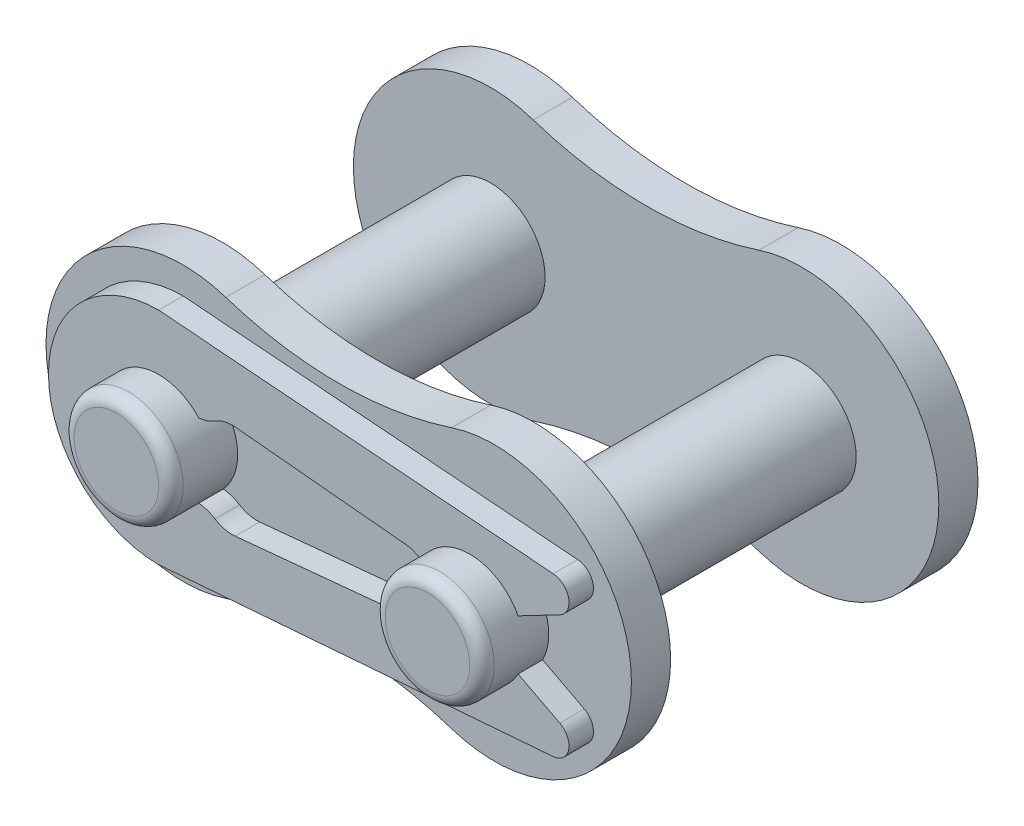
from build123d import *

# Parameters (mm, degrees)
BOSS_EXTRUDE1_START = 1.6
SKETCH3_R           = 2.225
BOSS_EXTRUDE1_DEPTH = 1.6
BOSS_EXTRUDE2_START = 1
BOSS_EXTRUDE2_DEPTH = 1


with BuildPart() as part:
    # Sketch1 → Revolve1 (revolve)
    with BuildSketch(Plane(origin=(0, 0, 0), x_dir=(1, 0, 0), z_dir=(0, 1, 0)), mode=Mode.PRIVATE) as revolve1_sk:
        with BuildLine():
            Line((0, -9.8), (0, 8.4))
            ThreePointArc((0, 8.4), (1.73173504, 8.05565255), (3.2, 7.075))
            Line((3.2, 7.075), (2.225, 7.075))
            Line((2.225, 7.075), (2.225, -9.3))
            ThreePointArc((2.225, -9.3), (2.078553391, -9.653553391), (1.725, -9.8))
            Line((1.725, -9.8), (0, -9.8))
        make_face()
    revolve(revolve1_sk.sketch.rotate(Axis((0, 0, -9.31), (0, 0, 1)), 180), axis=Axis((0, 0, -9.31), (0, 0, 1)))



with BuildPart() as body_2:
    # Sketch2 → Revolve2 (revolve)
    with BuildSketch(Plane.XZ, mode=Mode.PRIVATE) as revolve2_sk:
        with BuildLine():
            Line((-12.7, 9.8), (-14.425, 9.8))
            ThreePointArc((-14.425, 9.8), (-14.778553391, 9.653553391), (-14.925, 9.3))
            Line((-14.925, 9.3), (-14.925, -7.075))
            Line((-14.925, -7.075), (-15.9, -7.075))
            ThreePointArc((-15.9, -7.075), (-14.43173504, -8.05565255), (-12.7, -8.4))
            Line((-12.7, -8.4), (-12.7, 9.8))
        make_face()
    revolve(revolve2_sk.sketch.rotate(Axis((-12.7, 0, 9.8), (0, 0, -1)), 180), axis=Axis((-12.7, 0, 9.8), (0, 0, -1)))


with BuildPart() as part_1:
    add(part.part)

    add(body_2.part)  # Boss-Extrude1 merges body 2
    # Sketch3 → Boss-Extrude1 (add)
    with BuildSketch(Plane(origin=(0, 0, -7.075), x_dir=(0, 1, 0), z_dir=(0, 0, 1)).offset(BOSS_EXTRUDE1_START)):
        with BuildLine():
            ThreePointArc((-5.32235114, 1.741429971), (0, -5.6), (5.32235114, 1.741429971))
            ThreePointArc((5.32235114, 1.741429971), (4.587573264, 6.35), (5.32235114, 10.958570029))
            ThreePointArc((5.32235114, 10.958570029), (0, 18.3), (-5.32235114, 10.958570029))
            ThreePointArc((-5.32235114, 10.958570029), (-4.587573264, 6.35), (-5.32235114, 1.741429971))
        make_face()
        with Locations(Location((0, 0, 0), (0, 0, 90))):
            Circle(SKETCH3_R, mode=Mode.SUBTRACT)
        with Locations(Location((0, 12.7, 0), (0, 0, 270))):
            Circle(SKETCH3_R, mode=Mode.SUBTRACT)
    boss_extrude1 = extrude(amount=-BOSS_EXTRUDE1_DEPTH)

    # Mirror1: Boss-Extrude1 across plane
    add(boss_extrude1.mirror(Plane.XY))

    # Sketch4 → Boss-Extrude2 (add)
    with BuildSketch(Plane.XY.offset(7.075).offset(BOSS_EXTRUDE2_START)):
        with BuildLine():
            Line((3.407601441, 3.232304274), (-12.7, 4.5))
            ThreePointArc((-12.7, 4.5), (-17.2, 0), (-12.7, -4.5))
            Line((-12.7, -4.5), (3.407601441, -3.232304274))
            ThreePointArc((3.407601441, -3.232304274), (4.038627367, -2.674019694), (3.675904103, -1.913554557))
            Line((3.675904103, -1.913554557), (1.973599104, -1.027390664))
            ThreePointArc((1.973599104, -1.027390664), (0, -2.225), (-1.973599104, -1.027390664))
            Line((-1.973599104, -1.027390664), (-2.202654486, -1.146629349))
            ThreePointArc((-2.202654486, -1.146629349), (-2.380387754, -1.218438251), (-2.568557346, -1.255014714))
            Line((-2.568557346, -1.255014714), (-9.575400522, -1.929696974))
            ThreePointArc((-9.575400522, -1.929696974), (-10.002291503, -1.90004731), (-10.396428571, -1.733401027))
            ThreePointArc((-10.396428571, -1.733401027), (-10.715927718, -1.580255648), (-11.062434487, -1.50632141))
            ThreePointArc((-11.062434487, -1.50632141), (-14.925, 0), (-11.062434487, 1.50632141))
            ThreePointArc((-11.062434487, 1.50632141), (-10.715927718, 1.580255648), (-10.396428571, 1.733401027))
            ThreePointArc((-10.396428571, 1.733401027), (-10.002291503, 1.90004731), (-9.575400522, 1.929696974))
            Line((-9.575400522, 1.929696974), (-2.568557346, 1.255014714))
            ThreePointArc((-2.568557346, 1.255014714), (-2.380387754, 1.218438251), (-2.202654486, 1.146629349))
            Line((-2.202654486, 1.146629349), (-1.973599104, 1.027390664))
            ThreePointArc((-1.973599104, 1.027390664), (0, 2.225), (1.973599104, 1.027390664))
            Line((1.973599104, 1.027390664), (3.675904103, 1.913554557))
            ThreePointArc((3.675904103, 1.913554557), (4.038627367, 2.674019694), (3.407601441, 3.232304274))
        make_face()
    extrude(amount=-BOSS_EXTRUDE2_DEPTH)


solid = part_1.part
